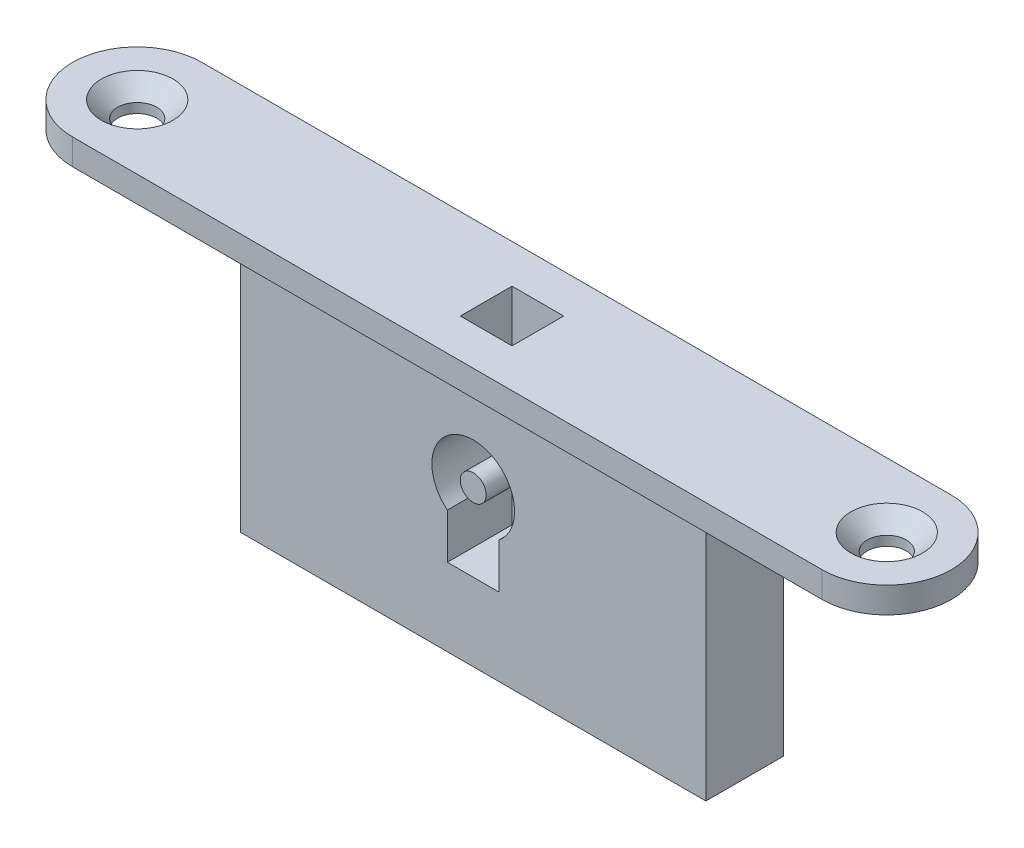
ISO-10303-21;
HEADER;
FILE_DESCRIPTION(('STEP AP214'),'2;1');
FILE_NAME('part.step','',(''),(''),'','','');
FILE_SCHEMA(('AUTOMOTIVE_DESIGN { 1 0 10303 214 1 1 1 1 }'));
ENDSEC;
DATA;
#1=APPLICATION_CONTEXT('core data for automotive mechanical design processes');
#2=APPLICATION_PROTOCOL_DEFINITION('international standard','automotive_design',2000,#1);
#3=PRODUCT_CONTEXT('',#1,'mechanical');
#4=PRODUCT('Part','Part','',(#3));
#5=PRODUCT_RELATED_PRODUCT_CATEGORY('part','',(#4));
#6=PRODUCT_DEFINITION_FORMATION('','',#4);
#7=PRODUCT_DEFINITION_CONTEXT('part definition',#1,'design');
#8=PRODUCT_DEFINITION('design','',#6,#7);
#9=PRODUCT_DEFINITION_SHAPE('','',#8);
#10=(LENGTH_UNIT() NAMED_UNIT(*) SI_UNIT(.MILLI.,.METRE.));
#11=(NAMED_UNIT(*) PLANE_ANGLE_UNIT() SI_UNIT($,.RADIAN.));
#12=(NAMED_UNIT(*) SI_UNIT($,.STERADIAN.) SOLID_ANGLE_UNIT());
#13=UNCERTAINTY_MEASURE_WITH_UNIT(LENGTH_MEASURE(1.E-05),#10,'distance_accuracy_value','');
#14=(GEOMETRIC_REPRESENTATION_CONTEXT(3) GLOBAL_UNCERTAINTY_ASSIGNED_CONTEXT((#13)) GLOBAL_UNIT_ASSIGNED_CONTEXT((#10,
#11,#12)) REPRESENTATION_CONTEXT('',''));
#15=CARTESIAN_POINT('',(0.,0.,0.));
#16=DIRECTION('',(0.,0.,1.));
#17=DIRECTION('',(1.,0.,0.));
#18=AXIS2_PLACEMENT_3D('',#15,#16,#17);
#19=CARTESIAN_POINT('',(-1.5875,-6.35,-1.5875));
#20=DIRECTION('',(0.,0.,-1.));
#21=DIRECTION('',(-1.,0.,0.));
#22=AXIS2_PLACEMENT_3D('',#19,#20,#21);
#23=PLANE('',#22);
#24=CARTESIAN_POINT('',(0.,-7.9375,-1.5875));
#25=DIRECTION('',(0.,0.,-1.));
#26=DIRECTION('',(-1.,0.,0.));
#27=AXIS2_PLACEMENT_3D('',#24,#25,#26);
#28=CIRCLE('',#27,2.54);
#29=CARTESIAN_POINT('',(1.5875,-9.92028686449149,-1.5875));
#30=VERTEX_POINT('',#29);
#31=CARTESIAN_POINT('',(1.5875,-5.95471313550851,-1.5875));
#32=VERTEX_POINT('',#31);
#33=EDGE_CURVE('E177',#30,#32,#28,.F.);
#34=ORIENTED_EDGE('',*,*,#33,.T.);
#35=DIRECTION('',(0.,1.,0.));
#36=VECTOR('',#35,1.);
#37=CARTESIAN_POINT('',(1.5875,-6.35,-1.5875));
#38=LINE('',#37,#36);
#39=CARTESIAN_POINT('',(1.5875,0.,-1.5875));
#40=VERTEX_POINT('',#39);
#41=EDGE_CURVE('E55',#32,#40,#38,.T.);
#42=ORIENTED_EDGE('',*,*,#41,.T.);
#43=DIRECTION('',(-1.,0.,0.));
#44=VECTOR('',#43,1.);
#45=CARTESIAN_POINT('',(-1.5875,0.,-1.5875));
#46=LINE('',#45,#44);
#47=CARTESIAN_POINT('',(-1.5875,0.,-1.5875));
#48=VERTEX_POINT('',#47);
#49=EDGE_CURVE('E197',#40,#48,#46,.T.);
#50=ORIENTED_EDGE('',*,*,#49,.T.);
#51=DIRECTION('',(0.,1.,0.));
#52=VECTOR('',#51,1.);
#53=CARTESIAN_POINT('',(-1.5875,-6.35,-1.5875));
#54=LINE('',#53,#52);
#55=CARTESIAN_POINT('',(-1.5875,-5.95471313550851,-1.5875));
#56=VERTEX_POINT('',#55);
#57=EDGE_CURVE('E210',#56,#48,#54,.T.);
#58=ORIENTED_EDGE('',*,*,#57,.F.);
#59=CARTESIAN_POINT('',(-1.5875,-9.92028686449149,-1.5875));
#60=VERTEX_POINT('',#59);
#61=EDGE_CURVE('E169',#56,#60,#28,.F.);
#62=ORIENTED_EDGE('',*,*,#61,.T.);
#63=DIRECTION('',(0.,-1.,0.));
#64=VECTOR('',#63,1.);
#65=CARTESIAN_POINT('',(-1.5875,-9.92028686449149,-1.5875));
#66=LINE('',#65,#64);
#67=CARTESIAN_POINT('',(-1.5875,-12.7,-1.5875));
#68=VERTEX_POINT('',#67);
#69=EDGE_CURVE('E161',#60,#68,#66,.T.);
#70=ORIENTED_EDGE('',*,*,#69,.T.);
#71=DIRECTION('',(1.,0.,0.));
#72=VECTOR('',#71,1.);
#73=CARTESIAN_POINT('',(1.5875,-12.7,-1.5875));
#74=LINE('',#73,#72);
#75=CARTESIAN_POINT('',(1.5875,-12.7,-1.5875));
#76=VERTEX_POINT('',#75);
#77=EDGE_CURVE('E148',#68,#76,#74,.T.);
#78=ORIENTED_EDGE('',*,*,#77,.T.);
#79=DIRECTION('',(0.,1.,0.));
#80=VECTOR('',#79,1.);
#81=CARTESIAN_POINT('',(1.5875,-9.92028686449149,-1.5875));
#82=LINE('',#81,#80);
#83=EDGE_CURVE('E180',#76,#30,#82,.T.);
#84=ORIENTED_EDGE('',*,*,#83,.T.);
#85=EDGE_LOOP('',(#34,#42,#50,#58,#62,#70,#78,#84));
#86=FACE_BOUND('',#85,.T.);
#87=CARTESIAN_POINT('',(0.,-7.9375,-1.5875));
#88=DIRECTION('',(0.,0.,-1.));
#89=DIRECTION('',(-1.,0.,0.));
#90=AXIS2_PLACEMENT_3D('',#87,#88,#89);
#91=CIRCLE('',#90,0.79375);
#92=CARTESIAN_POINT('',(-0.79375,-7.9375,-1.5875));
#93=VERTEX_POINT('',#92);
#94=EDGE_CURVE('E11',#93,#93,#91,.F.);
#95=ORIENTED_EDGE('',*,*,#94,.F.);
#96=EDGE_LOOP('',(#95));
#97=FACE_BOUND('',#96,.T.);
#98=ADVANCED_FACE('F32',(#86,#97),#23,.F.);
#99=CARTESIAN_POINT('',(-23.01875,-1.5875,0.));
#100=DIRECTION('',(0.,-1.,0.));
#101=DIRECTION('',(0.,0.,-1.));
#102=AXIS2_PLACEMENT_3D('',#99,#100,#101);
#103=PLANE('',#102);
#104=CARTESIAN_POINT('',(23.01875,-1.5875,0.));
#105=DIRECTION('',(0.,-1.,0.));
#106=DIRECTION('',(0.,0.,-1.));
#107=AXIS2_PLACEMENT_3D('',#104,#105,#106);
#108=CIRCLE('',#107,1.2);
#109=CARTESIAN_POINT('',(23.01875,-1.5875,-1.2));
#110=VERTEX_POINT('',#109);
#111=EDGE_CURVE('E275',#110,#110,#108,.T.);
#112=ORIENTED_EDGE('',*,*,#111,.F.);
#113=EDGE_LOOP('',(#112));
#114=FACE_BOUND('',#113,.T.);
#115=CARTESIAN_POINT('',(-23.01875,-1.5875,0.));
#116=DIRECTION('',(0.,-1.,0.));
#117=DIRECTION('',(0.,0.,-1.));
#118=AXIS2_PLACEMENT_3D('',#115,#116,#117);
#119=CIRCLE('',#118,1.2);
#120=CARTESIAN_POINT('',(-23.01875,-1.5875,-1.2));
#121=VERTEX_POINT('',#120);
#122=EDGE_CURVE('E272',#121,#121,#119,.T.);
#123=ORIENTED_EDGE('',*,*,#122,.F.);
#124=EDGE_LOOP('',(#123));
#125=FACE_BOUND('',#124,.T.);
#126=CARTESIAN_POINT('',(-23.01875,-1.5875,0.));
#127=DIRECTION('',(0.,1.,0.));
#128=DIRECTION('',(0.,0.,-1.));
#129=AXIS2_PLACEMENT_3D('',#126,#127,#128);
#130=CIRCLE('',#129,3.96875);
#131=CARTESIAN_POINT('',(-23.01875,-1.5875,-3.96875));
#132=VERTEX_POINT('',#131);
#133=CARTESIAN_POINT('',(-23.01875,-1.5875,3.96875));
#134=VERTEX_POINT('',#133);
#135=EDGE_CURVE('E242',#132,#134,#130,.T.);
#136=ORIENTED_EDGE('',*,*,#135,.F.);
#137=DIRECTION('',(-1.,0.,0.));
#138=VECTOR('',#137,1.);
#139=CARTESIAN_POINT('',(-23.01875,-1.5875,-3.96875));
#140=LINE('',#139,#138);
#141=CARTESIAN_POINT('',(23.01875,-1.5875,-3.96875));
#142=VERTEX_POINT('',#141);
#143=EDGE_CURVE('E252',#142,#132,#140,.T.);
#144=ORIENTED_EDGE('',*,*,#143,.F.);
#145=CARTESIAN_POINT('',(23.01875,-1.5875,0.));
#146=DIRECTION('',(0.,1.,0.));
#147=DIRECTION('',(0.,0.,1.));
#148=AXIS2_PLACEMENT_3D('',#145,#146,#147);
#149=CIRCLE('',#148,3.96875);
#150=CARTESIAN_POINT('',(23.01875,-1.5875,3.96875));
#151=VERTEX_POINT('',#150);
#152=EDGE_CURVE('E249',#151,#142,#149,.T.);
#153=ORIENTED_EDGE('',*,*,#152,.F.);
#154=DIRECTION('',(1.,0.,0.));
#155=VECTOR('',#154,1.);
#156=CARTESIAN_POINT('',(-23.01875,-1.5875,3.96875));
#157=LINE('',#156,#155);
#158=EDGE_CURVE('E245',#134,#151,#157,.T.);
#159=ORIENTED_EDGE('',*,*,#158,.F.);
#160=EDGE_LOOP('',(#136,#144,#153,#159));
#161=FACE_BOUND('',#160,.T.);
#162=DIRECTION('',(-1.,0.,0.));
#163=VECTOR('',#162,1.);
#164=CARTESIAN_POINT('',(-14.2875,-1.5875,2.38125));
#165=LINE('',#164,#163);
#166=CARTESIAN_POINT('',(14.2875,-1.5875,2.38125));
#167=VERTEX_POINT('',#166);
#168=CARTESIAN_POINT('',(-14.2875,-1.5875,2.38125));
#169=VERTEX_POINT('',#168);
#170=EDGE_CURVE('E226',#167,#169,#165,.T.);
#171=ORIENTED_EDGE('',*,*,#170,.F.);
#172=DIRECTION('',(0.,0.,1.));
#173=VECTOR('',#172,1.);
#174=CARTESIAN_POINT('',(14.2875,-1.5875,2.38125));
#175=LINE('',#174,#173);
#176=CARTESIAN_POINT('',(14.2875,-1.5875,-2.38125));
#177=VERTEX_POINT('',#176);
#178=EDGE_CURVE('E207',#177,#167,#175,.T.);
#179=ORIENTED_EDGE('',*,*,#178,.F.);
#180=DIRECTION('',(1.,0.,0.));
#181=VECTOR('',#180,1.);
#182=CARTESIAN_POINT('',(-14.2875,-1.5875,-2.38125));
#183=LINE('',#182,#181);
#184=CARTESIAN_POINT('',(-14.2875,-1.5875,-2.38125));
#185=VERTEX_POINT('',#184);
#186=EDGE_CURVE('E217',#185,#177,#183,.T.);
#187=ORIENTED_EDGE('',*,*,#186,.F.);
#188=DIRECTION('',(0.,0.,-1.));
#189=VECTOR('',#188,1.);
#190=CARTESIAN_POINT('',(-14.2875,-1.5875,2.38125));
#191=LINE('',#190,#189);
#192=EDGE_CURVE('E228',#169,#185,#191,.T.);
#193=ORIENTED_EDGE('',*,*,#192,.F.);
#194=EDGE_LOOP('',(#171,#179,#187,#193));
#195=FACE_BOUND('',#194,.T.);
#196=ADVANCED_FACE('F316',(#114,#125,#161,#195),#103,.T.);
#197=CARTESIAN_POINT('',(-23.01875,-1.5875,0.));
#198=DIRECTION('',(0.,1.,0.));
#199=DIRECTION('',(0.,0.,1.));
#200=AXIS2_PLACEMENT_3D('',#197,#198,#199);
#201=CYLINDRICAL_SURFACE('',#200,3.96875);
#202=CARTESIAN_POINT('',(-23.01875,0.,0.));
#203=DIRECTION('',(0.,1.,0.));
#204=DIRECTION('',(0.,0.,-1.));
#205=AXIS2_PLACEMENT_3D('',#202,#203,#204);
#206=CIRCLE('',#205,3.96875);
#207=CARTESIAN_POINT('',(-23.01875,0.,-3.96875));
#208=VERTEX_POINT('',#207);
#209=CARTESIAN_POINT('',(-23.01875,0.,3.96875));
#210=VERTEX_POINT('',#209);
#211=EDGE_CURVE('E241',#208,#210,#206,.T.);
#212=ORIENTED_EDGE('',*,*,#211,.F.);
#213=DIRECTION('',(0.,1.,0.));
#214=VECTOR('',#213,1.);
#215=CARTESIAN_POINT('',(-23.01875,-1.5875,-3.96875));
#216=LINE('',#215,#214);
#217=EDGE_CURVE('E40',#132,#208,#216,.T.);
#218=ORIENTED_EDGE('',*,*,#217,.F.);
#219=ORIENTED_EDGE('',*,*,#135,.T.);
#220=DIRECTION('',(0.,1.,0.));
#221=VECTOR('',#220,1.);
#222=CARTESIAN_POINT('',(-23.01875,-1.5875,3.96875));
#223=LINE('',#222,#221);
#224=EDGE_CURVE('E255',#134,#210,#223,.T.);
#225=ORIENTED_EDGE('',*,*,#224,.T.);
#226=EDGE_LOOP('',(#212,#218,#219,#225));
#227=FACE_BOUND('',#226,.T.);
#228=ADVANCED_FACE('F34',(#227),#201,.T.);
#229=CARTESIAN_POINT('',(-23.01875,-1.5875,-3.96875));
#230=DIRECTION('',(0.,0.,-1.));
#231=DIRECTION('',(-1.,0.,0.));
#232=AXIS2_PLACEMENT_3D('',#229,#230,#231);
#233=PLANE('',#232);
#234=DIRECTION('',(-1.,0.,0.));
#235=VECTOR('',#234,1.);
#236=CARTESIAN_POINT('',(-23.01875,0.,-3.96875));
#237=LINE('',#236,#235);
#238=CARTESIAN_POINT('',(23.01875,0.,-3.96875));
#239=VERTEX_POINT('',#238);
#240=EDGE_CURVE('E246',#239,#208,#237,.T.);
#241=ORIENTED_EDGE('',*,*,#240,.F.);
#242=DIRECTION('',(0.,1.,0.));
#243=VECTOR('',#242,1.);
#244=CARTESIAN_POINT('',(23.01875,-1.5875,-3.96875));
#245=LINE('',#244,#243);
#246=EDGE_CURVE('E267',#142,#239,#245,.T.);
#247=ORIENTED_EDGE('',*,*,#246,.F.);
#248=ORIENTED_EDGE('',*,*,#143,.T.);
#249=ORIENTED_EDGE('',*,*,#217,.T.);
#250=EDGE_LOOP('',(#241,#247,#248,#249));
#251=FACE_BOUND('',#250,.T.);
#252=ADVANCED_FACE('F493',(#251),#233,.T.);
#253=CARTESIAN_POINT('',(23.01875,-1.5875,0.));
#254=DIRECTION('',(0.,1.,0.));
#255=DIRECTION('',(0.,0.,1.));
#256=AXIS2_PLACEMENT_3D('',#253,#254,#255);
#257=CYLINDRICAL_SURFACE('',#256,3.96875);
#258=CARTESIAN_POINT('',(23.01875,0.,0.));
#259=DIRECTION('',(0.,1.,0.));
#260=DIRECTION('',(0.,0.,1.));
#261=AXIS2_PLACEMENT_3D('',#258,#259,#260);
#262=CIRCLE('',#261,3.96875);
#263=CARTESIAN_POINT('',(23.01875,0.,3.96875));
#264=VERTEX_POINT('',#263);
#265=EDGE_CURVE('E261',#264,#239,#262,.T.);
#266=ORIENTED_EDGE('',*,*,#265,.F.);
#267=DIRECTION('',(0.,1.,0.));
#268=VECTOR('',#267,1.);
#269=CARTESIAN_POINT('',(23.01875,-1.5875,3.96875));
#270=LINE('',#269,#268);
#271=EDGE_CURVE('E269',#151,#264,#270,.T.);
#272=ORIENTED_EDGE('',*,*,#271,.F.);
#273=ORIENTED_EDGE('',*,*,#152,.T.);
#274=ORIENTED_EDGE('',*,*,#246,.T.);
#275=EDGE_LOOP('',(#266,#272,#273,#274));
#276=FACE_BOUND('',#275,.T.);
#277=ADVANCED_FACE('F483',(#276),#257,.T.);
#278=CARTESIAN_POINT('',(-23.01875,-1.5875,3.96875));
#279=DIRECTION('',(0.,0.,1.));
#280=DIRECTION('',(1.,0.,0.));
#281=AXIS2_PLACEMENT_3D('',#278,#279,#280);
#282=PLANE('',#281);
#283=DIRECTION('',(1.,0.,0.));
#284=VECTOR('',#283,1.);
#285=CARTESIAN_POINT('',(-23.01875,0.,3.96875));
#286=LINE('',#285,#284);
#287=EDGE_CURVE('E258',#210,#264,#286,.T.);
#288=ORIENTED_EDGE('',*,*,#287,.F.);
#289=ORIENTED_EDGE('',*,*,#224,.F.);
#290=ORIENTED_EDGE('',*,*,#158,.T.);
#291=ORIENTED_EDGE('',*,*,#271,.T.);
#292=EDGE_LOOP('',(#288,#289,#290,#291));
#293=FACE_BOUND('',#292,.T.);
#294=ADVANCED_FACE('F478',(#293),#282,.T.);
#295=CARTESIAN_POINT('',(-23.01875,0.,0.));
#296=DIRECTION('',(0.,-1.,0.));
#297=DIRECTION('',(0.,0.,-1.));
#298=AXIS2_PLACEMENT_3D('',#295,#296,#297);
#299=PLANE('',#298);
#300=CARTESIAN_POINT('',(23.01875,0.,0.));
#301=DIRECTION('',(0.,1.,0.));
#302=DIRECTION('',(0.,0.,1.));
#303=AXIS2_PLACEMENT_3D('',#300,#301,#302);
#304=CIRCLE('',#303,2.2);
#305=CARTESIAN_POINT('',(23.01875,0.,2.2));
#306=VERTEX_POINT('',#305);
#307=EDGE_CURVE('E284',#306,#306,#304,.T.);
#308=ORIENTED_EDGE('',*,*,#307,.F.);
#309=EDGE_LOOP('',(#308));
#310=FACE_BOUND('',#309,.T.);
#311=CARTESIAN_POINT('',(-23.01875,0.,0.));
#312=DIRECTION('',(0.,1.,0.));
#313=DIRECTION('',(0.,0.,1.));
#314=AXIS2_PLACEMENT_3D('',#311,#312,#313);
#315=CIRCLE('',#314,2.2);
#316=CARTESIAN_POINT('',(-23.01875,0.,2.2));
#317=VERTEX_POINT('',#316);
#318=EDGE_CURVE('E277',#317,#317,#315,.T.);
#319=ORIENTED_EDGE('',*,*,#318,.F.);
#320=EDGE_LOOP('',(#319));
#321=FACE_BOUND('',#320,.T.);
#322=ORIENTED_EDGE('',*,*,#49,.F.);
#323=DIRECTION('',(0.,0.,-1.));
#324=VECTOR('',#323,1.);
#325=CARTESIAN_POINT('',(1.5875,0.,-1.5875));
#326=LINE('',#325,#324);
#327=CARTESIAN_POINT('',(1.5875,0.,1.5875));
#328=VERTEX_POINT('',#327);
#329=EDGE_CURVE('E195',#328,#40,#326,.T.);
#330=ORIENTED_EDGE('',*,*,#329,.F.);
#331=DIRECTION('',(1.,0.,0.));
#332=VECTOR('',#331,1.);
#333=CARTESIAN_POINT('',(-1.5875,0.,1.5875));
#334=LINE('',#333,#332);
#335=CARTESIAN_POINT('',(-1.5875,0.,1.5875));
#336=VERTEX_POINT('',#335);
#337=EDGE_CURVE('E202',#336,#328,#334,.T.);
#338=ORIENTED_EDGE('',*,*,#337,.F.);
#339=DIRECTION('',(0.,0.,1.));
#340=VECTOR('',#339,1.);
#341=CARTESIAN_POINT('',(-1.5875,0.,-1.5875));
#342=LINE('',#341,#340);
#343=EDGE_CURVE('E199',#48,#336,#342,.T.);
#344=ORIENTED_EDGE('',*,*,#343,.F.);
#345=EDGE_LOOP('',(#322,#330,#338,#344));
#346=FACE_BOUND('',#345,.T.);
#347=ORIENTED_EDGE('',*,*,#211,.T.);
#348=ORIENTED_EDGE('',*,*,#287,.T.);
#349=ORIENTED_EDGE('',*,*,#265,.T.);
#350=ORIENTED_EDGE('',*,*,#240,.T.);
#351=EDGE_LOOP('',(#347,#348,#349,#350));
#352=FACE_BOUND('',#351,.T.);
#353=ADVANCED_FACE('F471',(#310,#321,#346,#352),#299,.F.);
#354=CARTESIAN_POINT('',(14.2875,-17.4625,2.38125));
#355=DIRECTION('',(-1.,0.,0.));
#356=DIRECTION('',(0.,0.,1.));
#357=AXIS2_PLACEMENT_3D('',#354,#355,#356);
#358=PLANE('',#357);
#359=ORIENTED_EDGE('',*,*,#178,.T.);
#360=DIRECTION('',(0.,1.,0.));
#361=VECTOR('',#360,1.);
#362=CARTESIAN_POINT('',(14.2875,-17.4625,2.38125));
#363=LINE('',#362,#361);
#364=CARTESIAN_POINT('',(14.2875,-17.4625,2.38125));
#365=VERTEX_POINT('',#364);
#366=EDGE_CURVE('E239',#365,#167,#363,.T.);
#367=ORIENTED_EDGE('',*,*,#366,.F.);
#368=DIRECTION('',(0.,0.,1.));
#369=VECTOR('',#368,1.);
#370=CARTESIAN_POINT('',(14.2875,-17.4625,2.38125));
#371=LINE('',#370,#369);
#372=CARTESIAN_POINT('',(14.2875,-17.4625,-2.38125));
#373=VERTEX_POINT('',#372);
#374=EDGE_CURVE('E213',#373,#365,#371,.T.);
#375=ORIENTED_EDGE('',*,*,#374,.F.);
#376=DIRECTION('',(0.,1.,0.));
#377=VECTOR('',#376,1.);
#378=CARTESIAN_POINT('',(14.2875,-17.4625,-2.38125));
#379=LINE('',#378,#377);
#380=EDGE_CURVE('E223',#373,#177,#379,.T.);
#381=ORIENTED_EDGE('',*,*,#380,.T.);
#382=EDGE_LOOP('',(#359,#367,#375,#381));
#383=FACE_BOUND('',#382,.T.);
#384=ADVANCED_FACE('F304',(#383),#358,.F.);
#385=CARTESIAN_POINT('',(-14.2875,-17.4625,2.38125));
#386=DIRECTION('',(0.,0.,-1.));
#387=DIRECTION('',(-1.,0.,0.));
#388=AXIS2_PLACEMENT_3D('',#385,#386,#387);
#389=PLANE('',#388);
#390=DIRECTION('',(1.,0.,0.));
#391=VECTOR('',#390,1.);
#392=CARTESIAN_POINT('',(1.5875,-12.7,2.38125));
#393=LINE('',#392,#391);
#394=CARTESIAN_POINT('',(-1.5875,-12.7,2.38125));
#395=VERTEX_POINT('',#394);
#396=CARTESIAN_POINT('',(1.5875,-12.7,2.38125));
#397=VERTEX_POINT('',#396);
#398=EDGE_CURVE('E171',#395,#397,#393,.T.);
#399=ORIENTED_EDGE('',*,*,#398,.F.);
#400=DIRECTION('',(0.,-1.,0.));
#401=VECTOR('',#400,1.);
#402=CARTESIAN_POINT('',(-1.5875,-9.92028686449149,2.38125));
#403=LINE('',#402,#401);
#404=CARTESIAN_POINT('',(-1.5875,-9.92028686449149,2.38125));
#405=VERTEX_POINT('',#404);
#406=EDGE_CURVE('E164',#405,#395,#403,.T.);
#407=ORIENTED_EDGE('',*,*,#406,.F.);
#408=CARTESIAN_POINT('',(0.,-7.9375,2.38125));
#409=DIRECTION('',(0.,0.,1.));
#410=DIRECTION('',(1.,0.,0.));
#411=AXIS2_PLACEMENT_3D('',#408,#409,#410);
#412=CIRCLE('',#411,2.54);
#413=CARTESIAN_POINT('',(1.5875,-9.92028686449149,2.38125));
#414=VERTEX_POINT('',#413);
#415=EDGE_CURVE('E175',#414,#405,#412,.T.);
#416=ORIENTED_EDGE('',*,*,#415,.F.);
#417=DIRECTION('',(0.,1.,0.));
#418=VECTOR('',#417,1.);
#419=CARTESIAN_POINT('',(1.5875,-9.92028686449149,2.38125));
#420=LINE('',#419,#418);
#421=EDGE_CURVE('E47',#397,#414,#420,.T.);
#422=ORIENTED_EDGE('',*,*,#421,.F.);
#423=EDGE_LOOP('',(#399,#407,#416,#422));
#424=FACE_BOUND('',#423,.T.);
#425=ORIENTED_EDGE('',*,*,#170,.T.);
#426=DIRECTION('',(0.,1.,0.));
#427=VECTOR('',#426,1.);
#428=CARTESIAN_POINT('',(-14.2875,-17.4625,2.38125));
#429=LINE('',#428,#427);
#430=CARTESIAN_POINT('',(-14.2875,-17.4625,2.38125));
#431=VERTEX_POINT('',#430);
#432=EDGE_CURVE('E236',#431,#169,#429,.T.);
#433=ORIENTED_EDGE('',*,*,#432,.F.);
#434=DIRECTION('',(-1.,0.,0.));
#435=VECTOR('',#434,1.);
#436=CARTESIAN_POINT('',(-14.2875,-17.4625,2.38125));
#437=LINE('',#436,#435);
#438=EDGE_CURVE('E216',#365,#431,#437,.T.);
#439=ORIENTED_EDGE('',*,*,#438,.F.);
#440=ORIENTED_EDGE('',*,*,#366,.T.);
#441=EDGE_LOOP('',(#425,#433,#439,#440));
#442=FACE_BOUND('',#441,.T.);
#443=ADVANCED_FACE('F300',(#424,#442),#389,.F.);
#444=CARTESIAN_POINT('',(-14.2875,-17.4625,2.38125));
#445=DIRECTION('',(1.,0.,0.));
#446=DIRECTION('',(0.,0.,-1.));
#447=AXIS2_PLACEMENT_3D('',#444,#445,#446);
#448=PLANE('',#447);
#449=ORIENTED_EDGE('',*,*,#192,.T.);
#450=DIRECTION('',(0.,1.,0.));
#451=VECTOR('',#450,1.);
#452=CARTESIAN_POINT('',(-14.2875,-17.4625,-2.38125));
#453=LINE('',#452,#451);
#454=CARTESIAN_POINT('',(-14.2875,-17.4625,-2.38125));
#455=VERTEX_POINT('',#454);
#456=EDGE_CURVE('E234',#455,#185,#453,.T.);
#457=ORIENTED_EDGE('',*,*,#456,.F.);
#458=DIRECTION('',(0.,0.,-1.));
#459=VECTOR('',#458,1.);
#460=CARTESIAN_POINT('',(-14.2875,-17.4625,2.38125));
#461=LINE('',#460,#459);
#462=EDGE_CURVE('E219',#431,#455,#461,.T.);
#463=ORIENTED_EDGE('',*,*,#462,.F.);
#464=ORIENTED_EDGE('',*,*,#432,.T.);
#465=EDGE_LOOP('',(#449,#457,#463,#464));
#466=FACE_BOUND('',#465,.T.);
#467=ADVANCED_FACE('F303',(#466),#448,.F.);
#468=CARTESIAN_POINT('',(-14.2875,-17.4625,-2.38125));
#469=DIRECTION('',(0.,0.,1.));
#470=DIRECTION('',(1.,0.,0.));
#471=AXIS2_PLACEMENT_3D('',#468,#469,#470);
#472=PLANE('',#471);
#473=ORIENTED_EDGE('',*,*,#186,.T.);
#474=ORIENTED_EDGE('',*,*,#380,.F.);
#475=DIRECTION('',(1.,0.,0.));
#476=VECTOR('',#475,1.);
#477=CARTESIAN_POINT('',(-14.2875,-17.4625,-2.38125));
#478=LINE('',#477,#476);
#479=EDGE_CURVE('E221',#455,#373,#478,.T.);
#480=ORIENTED_EDGE('',*,*,#479,.F.);
#481=ORIENTED_EDGE('',*,*,#456,.T.);
#482=EDGE_LOOP('',(#473,#474,#480,#481));
#483=FACE_BOUND('',#482,.T.);
#484=ADVANCED_FACE('F319',(#483),#472,.F.);
#485=CARTESIAN_POINT('',(14.2875,-17.4625,-2.38125));
#486=DIRECTION('',(0.,-1.,0.));
#487=DIRECTION('',(0.,0.,-1.));
#488=AXIS2_PLACEMENT_3D('',#485,#486,#487);
#489=PLANE('',#488);
#490=ORIENTED_EDGE('',*,*,#374,.T.);
#491=ORIENTED_EDGE('',*,*,#438,.T.);
#492=ORIENTED_EDGE('',*,*,#462,.T.);
#493=ORIENTED_EDGE('',*,*,#479,.T.);
#494=EDGE_LOOP('',(#490,#491,#492,#493));
#495=FACE_BOUND('',#494,.T.);
#496=ADVANCED_FACE('F324',(#495),#489,.T.);
#497=CARTESIAN_POINT('',(1.5875,-6.35,-1.5875));
#498=DIRECTION('',(1.,0.,0.));
#499=DIRECTION('',(0.,0.,-1.));
#500=AXIS2_PLACEMENT_3D('',#497,#498,#499);
#501=PLANE('',#500);
#502=ORIENTED_EDGE('',*,*,#41,.F.);
#503=DIRECTION('',(0.,0.,1.));
#504=VECTOR('',#503,1.);
#505=CARTESIAN_POINT('',(1.5875,-5.95471313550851,-10.4831678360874));
#506=LINE('',#505,#504);
#507=CARTESIAN_POINT('',(1.5875,-5.95471313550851,1.5875));
#508=VERTEX_POINT('',#507);
#509=EDGE_CURVE('E192',#32,#508,#506,.T.);
#510=ORIENTED_EDGE('',*,*,#509,.T.);
#511=DIRECTION('',(0.,1.,0.));
#512=VECTOR('',#511,1.);
#513=CARTESIAN_POINT('',(1.5875,-6.35,1.5875));
#514=LINE('',#513,#512);
#515=EDGE_CURVE('E205',#508,#328,#514,.T.);
#516=ORIENTED_EDGE('',*,*,#515,.T.);
#517=ORIENTED_EDGE('',*,*,#329,.T.);
#518=EDGE_LOOP('',(#502,#510,#516,#517));
#519=FACE_BOUND('',#518,.T.);
#520=ADVANCED_FACE('F326',(#519),#501,.F.);
#521=CARTESIAN_POINT('',(-1.5875,-6.35,1.5875));
#522=DIRECTION('',(0.,0.,1.));
#523=DIRECTION('',(1.,0.,0.));
#524=AXIS2_PLACEMENT_3D('',#521,#522,#523);
#525=PLANE('',#524);
#526=ORIENTED_EDGE('',*,*,#515,.F.);
#527=CARTESIAN_POINT('',(0.,-7.9375,1.5875));
#528=DIRECTION('',(0.,0.,1.));
#529=DIRECTION('',(1.,0.,0.));
#530=AXIS2_PLACEMENT_3D('',#527,#528,#529);
#531=CIRCLE('',#530,2.54);
#532=CARTESIAN_POINT('',(-1.5875,-5.95471313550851,1.5875));
#533=VERTEX_POINT('',#532);
#534=EDGE_CURVE('E189',#508,#533,#531,.T.);
#535=ORIENTED_EDGE('',*,*,#534,.T.);
#536=DIRECTION('',(0.,1.,0.));
#537=VECTOR('',#536,1.);
#538=CARTESIAN_POINT('',(-1.5875,-6.35,1.5875));
#539=LINE('',#538,#537);
#540=EDGE_CURVE('E208',#533,#336,#539,.T.);
#541=ORIENTED_EDGE('',*,*,#540,.T.);
#542=ORIENTED_EDGE('',*,*,#337,.T.);
#543=EDGE_LOOP('',(#526,#535,#541,#542));
#544=FACE_BOUND('',#543,.T.);
#545=ADVANCED_FACE('F332',(#544),#525,.F.);
#546=CARTESIAN_POINT('',(-1.5875,-6.35,-1.5875));
#547=DIRECTION('',(-1.,0.,0.));
#548=DIRECTION('',(0.,0.,1.));
#549=AXIS2_PLACEMENT_3D('',#546,#547,#548);
#550=PLANE('',#549);
#551=ORIENTED_EDGE('',*,*,#540,.F.);
#552=DIRECTION('',(0.,0.,1.));
#553=VECTOR('',#552,1.);
#554=CARTESIAN_POINT('',(-1.5875,-5.95471313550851,-10.4831678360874));
#555=LINE('',#554,#553);
#556=EDGE_CURVE('E186',#533,#56,#555,.F.);
#557=ORIENTED_EDGE('',*,*,#556,.T.);
#558=ORIENTED_EDGE('',*,*,#57,.T.);
#559=ORIENTED_EDGE('',*,*,#343,.T.);
#560=EDGE_LOOP('',(#551,#557,#558,#559));
#561=FACE_BOUND('',#560,.T.);
#562=ADVANCED_FACE('F344',(#561),#550,.F.);
#563=CARTESIAN_POINT('',(0.,-7.9375,-10.4831678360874));
#564=DIRECTION('',(0.,0.,1.));
#565=DIRECTION('',(1.,0.,0.));
#566=AXIS2_PLACEMENT_3D('',#563,#564,#565);
#567=CYLINDRICAL_SURFACE('',#566,2.54);
#568=ORIENTED_EDGE('',*,*,#33,.F.);
#569=DIRECTION('',(0.,0.,1.));
#570=VECTOR('',#569,1.);
#571=CARTESIAN_POINT('',(1.5875,-9.92028686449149,-10.4831678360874));
#572=LINE('',#571,#570);
#573=EDGE_CURVE('E181',#30,#414,#572,.T.);
#574=ORIENTED_EDGE('',*,*,#573,.T.);
#575=ORIENTED_EDGE('',*,*,#415,.T.);
#576=DIRECTION('',(0.,0.,1.));
#577=VECTOR('',#576,1.);
#578=CARTESIAN_POINT('',(-1.5875,-9.92028686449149,-10.4831678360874));
#579=LINE('',#578,#577);
#580=EDGE_CURVE('E179',#60,#405,#579,.T.);
#581=ORIENTED_EDGE('',*,*,#580,.F.);
#582=ORIENTED_EDGE('',*,*,#61,.F.);
#583=ORIENTED_EDGE('',*,*,#556,.F.);
#584=ORIENTED_EDGE('',*,*,#534,.F.);
#585=ORIENTED_EDGE('',*,*,#509,.F.);
#586=EDGE_LOOP('',(#568,#574,#575,#581,#582,#583,#584,#585));
#587=FACE_BOUND('',#586,.T.);
#588=ADVANCED_FACE('F298',(#587),#567,.F.);
#589=CARTESIAN_POINT('',(-1.5875,-9.92028686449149,-10.4831678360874));
#590=DIRECTION('',(-1.,0.,0.));
#591=DIRECTION('',(0.,-1.,0.));
#592=AXIS2_PLACEMENT_3D('',#589,#590,#591);
#593=PLANE('',#592);
#594=ORIENTED_EDGE('',*,*,#580,.T.);
#595=ORIENTED_EDGE('',*,*,#406,.T.);
#596=DIRECTION('',(0.,0.,1.));
#597=VECTOR('',#596,1.);
#598=CARTESIAN_POINT('',(-1.5875,-12.7,-10.4831678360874));
#599=LINE('',#598,#597);
#600=EDGE_CURVE('E152',#68,#395,#599,.T.);
#601=ORIENTED_EDGE('',*,*,#600,.F.);
#602=ORIENTED_EDGE('',*,*,#69,.F.);
#603=EDGE_LOOP('',(#594,#595,#601,#602));
#604=FACE_BOUND('',#603,.T.);
#605=ADVANCED_FACE('F160',(#604),#593,.F.);
#606=CARTESIAN_POINT('',(1.5875,-12.7,-10.4831678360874));
#607=DIRECTION('',(0.,-1.,0.));
#608=DIRECTION('',(0.,0.,-1.));
#609=AXIS2_PLACEMENT_3D('',#606,#607,#608);
#610=PLANE('',#609);
#611=ORIENTED_EDGE('',*,*,#600,.T.);
#612=ORIENTED_EDGE('',*,*,#398,.T.);
#613=DIRECTION('',(0.,0.,1.));
#614=VECTOR('',#613,1.);
#615=CARTESIAN_POINT('',(1.5875,-12.7,-10.4831678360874));
#616=LINE('',#615,#614);
#617=EDGE_CURVE('E154',#76,#397,#616,.T.);
#618=ORIENTED_EDGE('',*,*,#617,.F.);
#619=ORIENTED_EDGE('',*,*,#77,.F.);
#620=EDGE_LOOP('',(#611,#612,#618,#619));
#621=FACE_BOUND('',#620,.T.);
#622=ADVANCED_FACE('F150',(#621),#610,.F.);
#623=CARTESIAN_POINT('',(1.5875,-9.92028686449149,-10.4831678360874));
#624=DIRECTION('',(1.,0.,0.));
#625=DIRECTION('',(0.,1.,0.));
#626=AXIS2_PLACEMENT_3D('',#623,#624,#625);
#627=PLANE('',#626);
#628=ORIENTED_EDGE('',*,*,#617,.T.);
#629=ORIENTED_EDGE('',*,*,#421,.T.);
#630=ORIENTED_EDGE('',*,*,#573,.F.);
#631=ORIENTED_EDGE('',*,*,#83,.F.);
#632=EDGE_LOOP('',(#628,#629,#630,#631));
#633=FACE_BOUND('',#632,.T.);
#634=ADVANCED_FACE('F355',(#633),#627,.F.);
#635=CARTESIAN_POINT('',(-23.01875,0.,0.));
#636=DIRECTION('',(0.,1.,0.));
#637=DIRECTION('',(0.,0.,1.));
#638=AXIS2_PLACEMENT_3D('',#635,#636,#637);
#639=CYLINDRICAL_SURFACE('',#638,1.2);
#640=ORIENTED_EDGE('',*,*,#122,.T.);
#641=EDGE_LOOP('',(#640));
#642=FACE_BOUND('',#641,.T.);
#643=CARTESIAN_POINT('',(-23.01875,-1.,0.));
#644=DIRECTION('',(0.,1.,0.));
#645=DIRECTION('',(0.,0.,1.));
#646=AXIS2_PLACEMENT_3D('',#643,#644,#645);
#647=CIRCLE('',#646,1.2);
#648=CARTESIAN_POINT('',(-23.01875,-1.,1.2));
#649=VERTEX_POINT('',#648);
#650=EDGE_CURVE('E274',#649,#649,#647,.T.);
#651=ORIENTED_EDGE('',*,*,#650,.T.);
#652=EDGE_LOOP('',(#651));
#653=FACE_BOUND('',#652,.T.);
#654=ADVANCED_FACE('F358',(#642,#653),#639,.F.);
#655=CARTESIAN_POINT('',(-23.01875,0.,0.));
#656=DIRECTION('',(0.,1.,0.));
#657=DIRECTION('',(0.,0.,1.));
#658=AXIS2_PLACEMENT_3D('',#655,#656,#657);
#659=CONICAL_SURFACE('',#658,2.2,0.785398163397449);
#660=ORIENTED_EDGE('',*,*,#650,.F.);
#661=EDGE_LOOP('',(#660));
#662=FACE_BOUND('',#661,.T.);
#663=ORIENTED_EDGE('',*,*,#318,.T.);
#664=EDGE_LOOP('',(#663));
#665=FACE_BOUND('',#664,.T.);
#666=ADVANCED_FACE('F363',(#662,#665),#659,.F.);
#667=CARTESIAN_POINT('',(23.01875,0.,0.));
#668=DIRECTION('',(0.,1.,0.));
#669=DIRECTION('',(0.,0.,1.));
#670=AXIS2_PLACEMENT_3D('',#667,#668,#669);
#671=CYLINDRICAL_SURFACE('',#670,1.2);
#672=ORIENTED_EDGE('',*,*,#111,.T.);
#673=EDGE_LOOP('',(#672));
#674=FACE_BOUND('',#673,.T.);
#675=CARTESIAN_POINT('',(23.01875,-1.,0.));
#676=DIRECTION('',(0.,1.,0.));
#677=DIRECTION('',(0.,0.,1.));
#678=AXIS2_PLACEMENT_3D('',#675,#676,#677);
#679=CIRCLE('',#678,1.2);
#680=CARTESIAN_POINT('',(23.01875,-1.,1.2));
#681=VERTEX_POINT('',#680);
#682=EDGE_CURVE('E278',#681,#681,#679,.T.);
#683=ORIENTED_EDGE('',*,*,#682,.T.);
#684=EDGE_LOOP('',(#683));
#685=FACE_BOUND('',#684,.T.);
#686=ADVANCED_FACE('F367',(#674,#685),#671,.F.);
#687=CARTESIAN_POINT('',(23.01875,0.,0.));
#688=DIRECTION('',(0.,1.,0.));
#689=DIRECTION('',(0.,0.,1.));
#690=AXIS2_PLACEMENT_3D('',#687,#688,#689);
#691=CONICAL_SURFACE('',#690,2.2,0.785398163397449);
#692=ORIENTED_EDGE('',*,*,#682,.F.);
#693=EDGE_LOOP('',(#692));
#694=FACE_BOUND('',#693,.T.);
#695=ORIENTED_EDGE('',*,*,#307,.T.);
#696=EDGE_LOOP('',(#695));
#697=FACE_BOUND('',#696,.T.);
#698=ADVANCED_FACE('F371',(#694,#697),#691,.F.);
#699=CARTESIAN_POINT('',(0.,-7.9375,4.62631403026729));
#700=DIRECTION('',(0.,0.,-1.));
#701=DIRECTION('',(-1.,0.,0.));
#702=AXIS2_PLACEMENT_3D('',#699,#700,#701);
#703=CYLINDRICAL_SURFACE('',#702,0.79375);
#704=CARTESIAN_POINT('',(0.,-7.9375,2.38125));
#705=DIRECTION('',(0.,0.,-1.));
#706=DIRECTION('',(-1.,0.,0.));
#707=AXIS2_PLACEMENT_3D('',#704,#705,#706);
#708=CIRCLE('',#707,0.79375);
#709=CARTESIAN_POINT('',(-0.79375,-7.9375,2.38125));
#710=VERTEX_POINT('',#709);
#711=EDGE_CURVE('E289',#710,#710,#708,.T.);
#712=ORIENTED_EDGE('',*,*,#711,.T.);
#713=EDGE_LOOP('',(#712));
#714=FACE_BOUND('',#713,.T.);
#715=ORIENTED_EDGE('',*,*,#94,.T.);
#716=EDGE_LOOP('',(#715));
#717=FACE_BOUND('',#716,.T.);
#718=ADVANCED_FACE('F374',(#714,#717),#703,.T.);
#719=CARTESIAN_POINT('',(-14.2875,-17.4625,2.38125));
#720=DIRECTION('',(0.,0.,-1.));
#721=DIRECTION('',(-1.,0.,0.));
#722=AXIS2_PLACEMENT_3D('',#719,#720,#721);
#723=PLANE('',#722);
#724=ORIENTED_EDGE('',*,*,#711,.F.);
#725=EDGE_LOOP('',(#724));
#726=FACE_BOUND('',#725,.T.);
#727=ADVANCED_FACE('F378',(#726),#723,.F.);
#728=CLOSED_SHELL('',(#98,#196,#228,#252,#277,#294,#353,#384,#443,#467,#484,#496,#520,#545,#562,
#588,#605,#622,#634,#654,#666,#686,#698,#718,#727));
#729=MANIFOLD_SOLID_BREP('B2',#728);
#730=ADVANCED_BREP_SHAPE_REPRESENTATION('',(#18,#729),#14);
#731=SHAPE_DEFINITION_REPRESENTATION(#9,#730);
ENDSEC;
END-ISO-10303-21;
